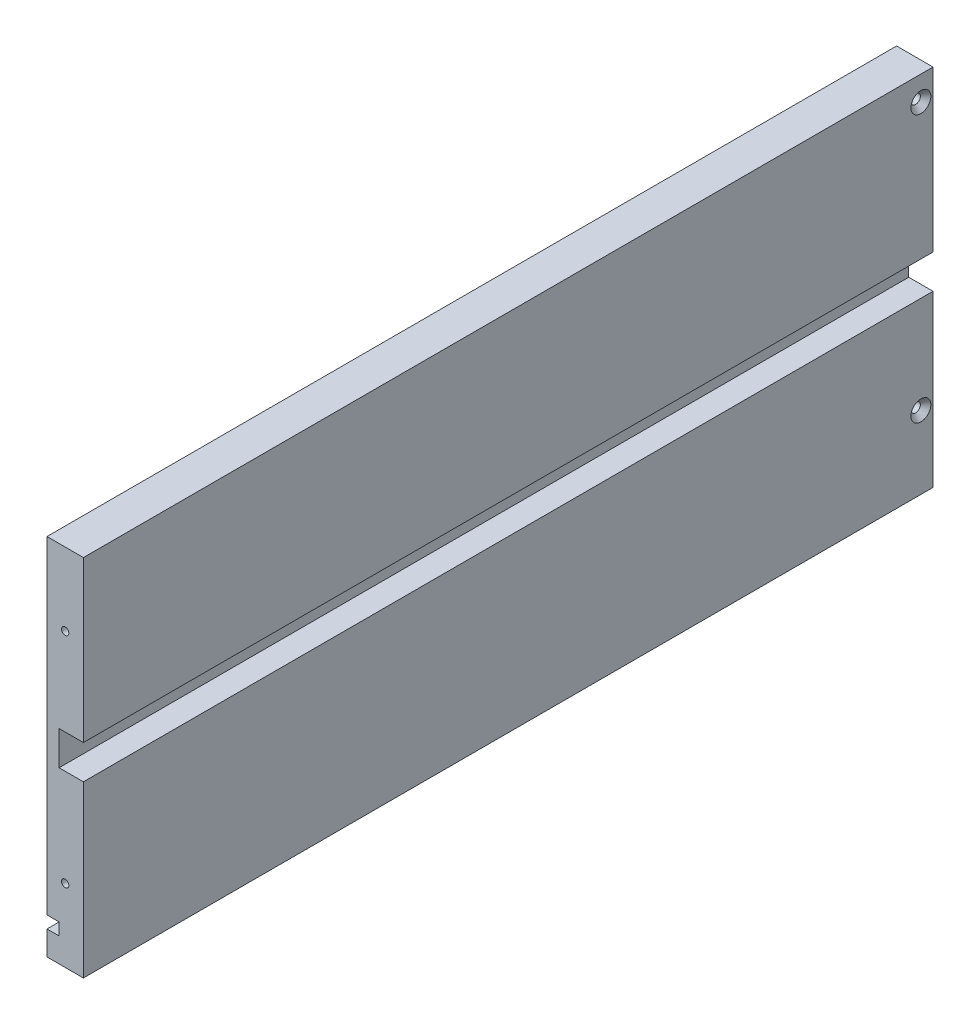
from build123d import *

# Parameters (mm, degrees)
SKETCH2_W                                         = 350
SKETCH2_H                                         = 150
BASE_EXTRUDE_DEPTH                                = 15
SKETCH3_W                                         = 10
SKETCH3_H                                         = 14
CUT_EXTRUDE1_DEPTH                                = 382.083980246
SKETCH4_W                                         = 5
SKETCH4_H                                         = 5
CUT_EXTRUDE2_DEPTH                                = 382.083980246
CSK_FOR_M3_5_FLAT_HEAD_MACHINE_SCREW1_D           = 3.9
CSK_FOR_M3_5_FLAT_HEAD_MACHINE_SCREW1_CSINK_D     = 8.2
CSK_FOR_M3_5_FLAT_HEAD_MACHINE_SCREW1_CSINK_ANGLE = 90
M3_0_3_000000_DIAMETER_HOLE1_D                    = 3
M3_0_3_000000_DIAMETER_HOLE1_DEPTH                = 10
M3_0_3_000000_DIAMETER_HOLE1_TIP                  = 0.901290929


with BuildPart() as part:
    # Sketch2 → Base-Extrude (new body)
    with BuildSketch(Plane(origin=(0, 0, 0), x_dir=(0, 0, -1), z_dir=(1, 0, 0))):
        with Locations((175, 75)):
            Rectangle(SKETCH2_W, SKETCH2_H)
    extrude(amount=-BASE_EXTRUDE_DEPTH)

    # Sketch3 → Cut-Extrude1 (cut, through all)
    with BuildSketch(Plane.XY):
        with Locations((-5, 77)):
            Rectangle(SKETCH3_W, SKETCH3_H)
    extrude(amount=-CUT_EXTRUDE1_DEPTH, mode=Mode.SUBTRACT)

    # Sketch4 → Cut-Extrude2 (cut, through all)
    with BuildSketch(Plane.XY):
        with Locations((-12.5, 12.5)):
            Rectangle(SKETCH4_W, SKETCH4_H)
    extrude(amount=-CUT_EXTRUDE2_DEPTH, mode=Mode.SUBTRACT)

    # CSK for M3.5 Flat Head Machine Screw1 (through all)
    with Locations(Plane(origin=(0, 0, 0), x_dir=(0, 0, -1), z_dir=(1, 0, 0))):
        with Locations((345, 140), (345, 30)):
            CounterSinkHole(CSK_FOR_M3_5_FLAT_HEAD_MACHINE_SCREW1_D / 2, CSK_FOR_M3_5_FLAT_HEAD_MACHINE_SCREW1_CSINK_D / 2, counter_sink_angle=CSK_FOR_M3_5_FLAT_HEAD_MACHINE_SCREW1_CSINK_ANGLE)

    # M3.0 _3.000000_ Diameter Hole1
    with Locations(Plane.XY):
        with Locations((-7.5, 30), (-7.5, 120)):
            Hole(M3_0_3_000000_DIAMETER_HOLE1_D / 2, depth=M3_0_3_000000_DIAMETER_HOLE1_DEPTH)
            with Locations((0, 0, -(M3_0_3_000000_DIAMETER_HOLE1_DEPTH + M3_0_3_000000_DIAMETER_HOLE1_TIP / 2))):  # 118° drill point
                Cone(0, M3_0_3_000000_DIAMETER_HOLE1_D / 2, M3_0_3_000000_DIAMETER_HOLE1_TIP, mode=Mode.SUBTRACT)


solid = part.part
